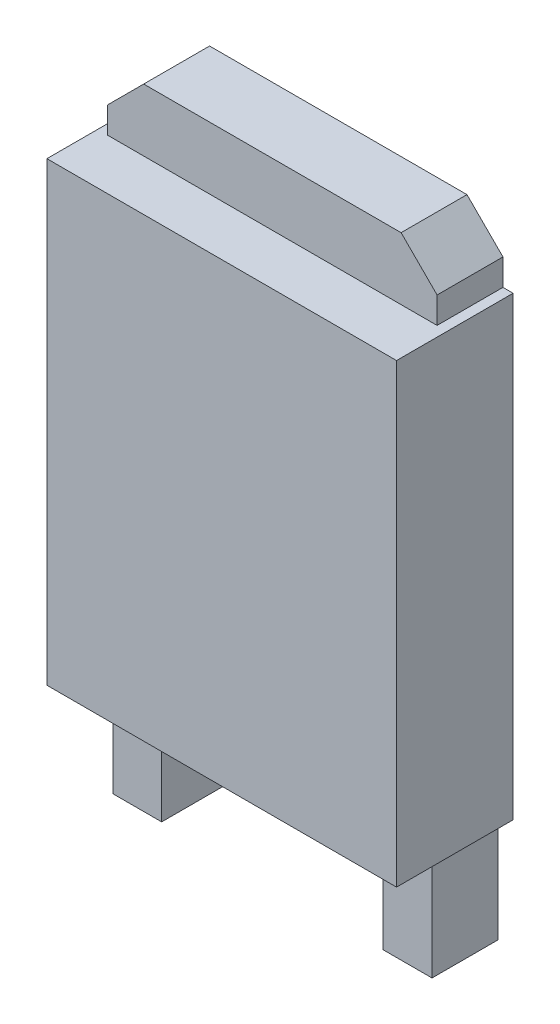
from build123d import *

# Parameters (mm, degrees)
SKETCH1_W           = 6.9
SKETCH1_H           = 9
BOSS_EXTRUDE1_DEPTH = 2.3
SKETCH2_W           = 0.964703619
SKETCH2_H           = 2.203085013
BOSS_EXTRUDE2_DEPTH = 1.3
SKETCH3_W           = 0.964703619
SKETCH3_H           = 2.203085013
BOSS_EXTRUDE3_DEPTH = 0.0001


with BuildPart() as part:
    # Sketch1 → Boss-Extrude1 (new body)
    with BuildSketch(Plane.XY):
        Rectangle(SKETCH1_W, SKETCH1_H)
    extrude(amount=BOSS_EXTRUDE1_DEPTH)

    # Sketch2 → Boss-Extrude2 (add)
    with BuildSketch(Plane(origin=(0, 0, 0), x_dir=(-1, 0, 0), z_dir=(0, 0, -1))):
        Polygon((3.25, 4.5), (3.25, 5.020423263), (2.54, 5.730423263), (-2.54, 5.730423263), (-3.25, 5.020423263), (-3.25, 4.5), align=None)
        with Locations((-2.667648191, -5.601542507)):
            Rectangle(SKETCH2_W, SKETCH2_H)
        with Locations((2.667648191, -5.601542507)):
            Rectangle(SKETCH2_W, SKETCH2_H)
    extrude(amount=-BOSS_EXTRUDE2_DEPTH)

    # Sketch3 → Boss-Extrude3 (add)
    with BuildSketch(Plane(origin=(0, 0, 0), x_dir=(-1, 0, 0), z_dir=(0, 0, -1))):
        Polygon((-3.25, 4.5), (-3.25, 5.020423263), (-2.54, 5.730423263), (2.54, 5.730423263), (3.25, 5.020423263), (3.25, 4.5), align=None)
        with Locations((-2.667648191, -5.601542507)):
            Rectangle(SKETCH3_W, SKETCH3_H)
        with Locations((2.667648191, -5.601542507)):
            Rectangle(SKETCH3_W, SKETCH3_H)
    extrude(amount=BOSS_EXTRUDE3_DEPTH)


solid = part.part
